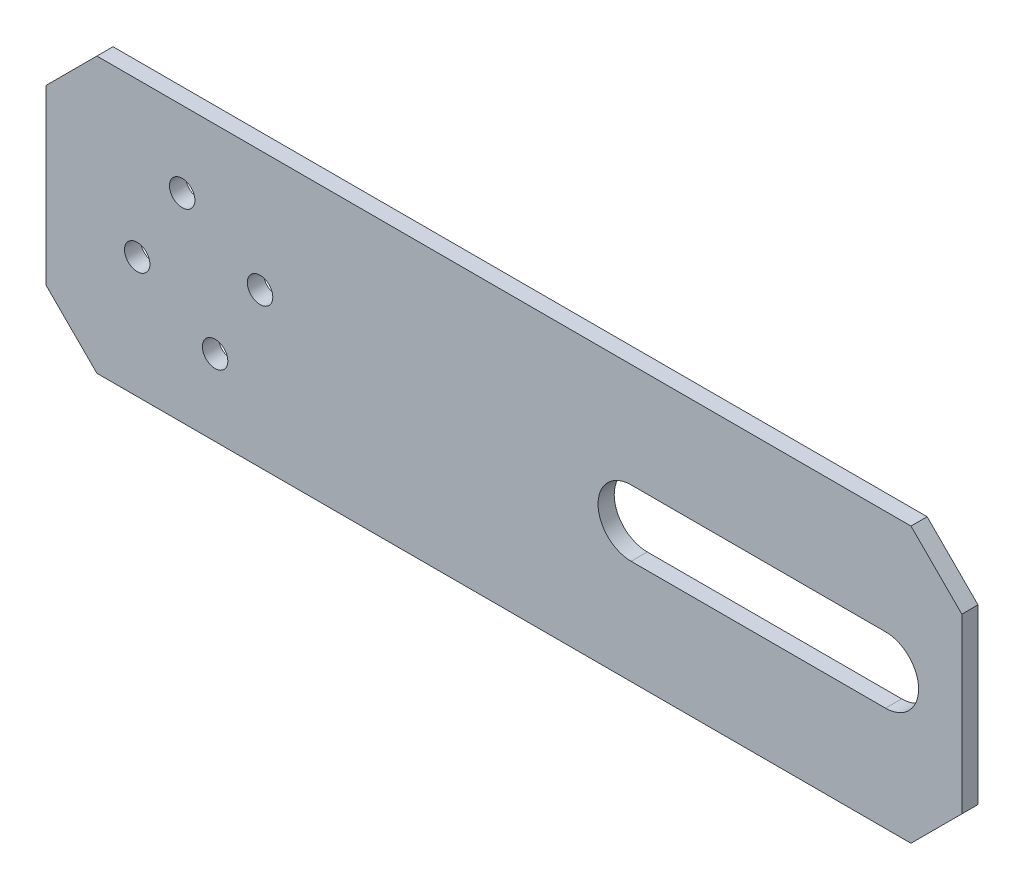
ISO-10303-21;
HEADER;
FILE_DESCRIPTION(('STEP AP214'),'2;1');
FILE_NAME('part.step','',(''),(''),'','','');
FILE_SCHEMA(('AUTOMOTIVE_DESIGN { 1 0 10303 214 1 1 1 1 }'));
ENDSEC;
DATA;
#1=APPLICATION_CONTEXT('core data for automotive mechanical design processes');
#2=APPLICATION_PROTOCOL_DEFINITION('international standard','automotive_design',2000,#1);
#3=PRODUCT_CONTEXT('',#1,'mechanical');
#4=PRODUCT('Part','Part','',(#3));
#5=PRODUCT_RELATED_PRODUCT_CATEGORY('part','',(#4));
#6=PRODUCT_DEFINITION_FORMATION('','',#4);
#7=PRODUCT_DEFINITION_CONTEXT('part definition',#1,'design');
#8=PRODUCT_DEFINITION('design','',#6,#7);
#9=PRODUCT_DEFINITION_SHAPE('','',#8);
#10=(LENGTH_UNIT() NAMED_UNIT(*) SI_UNIT(.MILLI.,.METRE.));
#11=(NAMED_UNIT(*) PLANE_ANGLE_UNIT() SI_UNIT($,.RADIAN.));
#12=(NAMED_UNIT(*) SI_UNIT($,.STERADIAN.) SOLID_ANGLE_UNIT());
#13=UNCERTAINTY_MEASURE_WITH_UNIT(LENGTH_MEASURE(1.E-05),#10,'distance_accuracy_value','');
#14=(GEOMETRIC_REPRESENTATION_CONTEXT(3) GLOBAL_UNCERTAINTY_ASSIGNED_CONTEXT((#13)) GLOBAL_UNIT_ASSIGNED_CONTEXT((#10,
#11,#12)) REPRESENTATION_CONTEXT('',''));
#15=CARTESIAN_POINT('',(0.,0.,0.));
#16=DIRECTION('',(0.,0.,1.));
#17=DIRECTION('',(1.,0.,0.));
#18=AXIS2_PLACEMENT_3D('',#15,#16,#17);
#19=CARTESIAN_POINT('',(-30.,-27.,1.5875));
#20=DIRECTION('',(0.,0.,1.));
#21=DIRECTION('',(1.,0.,0.));
#22=AXIS2_PLACEMENT_3D('',#19,#20,#21);
#23=PLANE('',#22);
#24=CARTESIAN_POINT('',(12.0740728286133,3.23523806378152,1.5875));
#25=DIRECTION('',(0.,0.,1.));
#26=DIRECTION('',(1.,0.,0.));
#27=AXIS2_PLACEMENT_3D('',#24,#25,#26);
#28=CIRCLE('',#27,2.50000000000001);
#29=CARTESIAN_POINT('',(14.5740728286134,3.23523806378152,1.5875));
#30=VERTEX_POINT('',#29);
#31=EDGE_CURVE('E171',#30,#30,#28,.T.);
#32=ORIENTED_EDGE('',*,*,#31,.F.);
#33=EDGE_LOOP('',(#32));
#34=FACE_BOUND('',#33,.T.);
#35=CARTESIAN_POINT('',(-3.23523806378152,12.0740728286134,1.5875));
#36=DIRECTION('',(0.,0.,1.));
#37=DIRECTION('',(1.,0.,0.));
#38=AXIS2_PLACEMENT_3D('',#35,#36,#37);
#39=CIRCLE('',#38,2.49999999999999);
#40=CARTESIAN_POINT('',(-0.735238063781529,12.0740728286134,1.5875));
#41=VERTEX_POINT('',#40);
#42=EDGE_CURVE('E183',#41,#41,#39,.T.);
#43=ORIENTED_EDGE('',*,*,#42,.F.);
#44=EDGE_LOOP('',(#43));
#45=FACE_BOUND('',#44,.T.);
#46=DIRECTION('',(-1.,0.,0.));
#47=VECTOR('',#46,1.);
#48=CARTESIAN_POINT('',(-30.,27.,1.5875));
#49=LINE('',#48,#47);
#50=CARTESIAN_POINT('',(140.,27.,1.5875));
#51=VERTEX_POINT('',#50);
#52=CARTESIAN_POINT('',(-19.9999999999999,27.,1.5875));
#53=VERTEX_POINT('',#52);
#54=EDGE_CURVE('E210',#51,#53,#49,.T.);
#55=ORIENTED_EDGE('',*,*,#54,.T.);
#56=DIRECTION('',(0.707106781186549,0.707106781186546,0.));
#57=VECTOR('',#56,1.);
#58=CARTESIAN_POINT('',(-52.,-4.99999999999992,1.5875));
#59=LINE('',#58,#57);
#60=CARTESIAN_POINT('',(-30.,17.,1.5875));
#61=VERTEX_POINT('',#60);
#62=EDGE_CURVE('E236',#53,#61,#59,.F.);
#63=ORIENTED_EDGE('',*,*,#62,.T.);
#64=DIRECTION('',(0.,-1.,0.));
#65=VECTOR('',#64,1.);
#66=CARTESIAN_POINT('',(-30.,27.,1.5875));
#67=LINE('',#66,#65);
#68=CARTESIAN_POINT('',(-30.,-17.,1.5875));
#69=VERTEX_POINT('',#68);
#70=EDGE_CURVE('E203',#61,#69,#67,.T.);
#71=ORIENTED_EDGE('',*,*,#70,.T.);
#72=DIRECTION('',(-0.707106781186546,0.707106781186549,0.));
#73=VECTOR('',#72,1.);
#74=CARTESIAN_POINT('',(-24.9999999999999,-22.,1.5875));
#75=LINE('',#74,#73);
#76=CARTESIAN_POINT('',(-19.9999999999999,-27.,1.5875));
#77=VERTEX_POINT('',#76);
#78=EDGE_CURVE('E234',#69,#77,#75,.F.);
#79=ORIENTED_EDGE('',*,*,#78,.T.);
#80=DIRECTION('',(1.,0.,0.));
#81=VECTOR('',#80,1.);
#82=CARTESIAN_POINT('',(-30.,-27.,1.5875));
#83=LINE('',#82,#81);
#84=CARTESIAN_POINT('',(140.,-27.,1.5875));
#85=VERTEX_POINT('',#84);
#86=EDGE_CURVE('E206',#77,#85,#83,.T.);
#87=ORIENTED_EDGE('',*,*,#86,.T.);
#88=DIRECTION('',(-0.707106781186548,-0.707106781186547,0.));
#89=VECTOR('',#88,1.);
#90=CARTESIAN_POINT('',(54.9999999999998,-112.,1.5875));
#91=LINE('',#90,#89);
#92=CARTESIAN_POINT('',(150.,-17.,1.5875));
#93=VERTEX_POINT('',#92);
#94=EDGE_CURVE('E57',#85,#93,#91,.F.);
#95=ORIENTED_EDGE('',*,*,#94,.T.);
#96=DIRECTION('',(0.,1.,0.));
#97=VECTOR('',#96,1.);
#98=CARTESIAN_POINT('',(150.,27.,1.5875));
#99=LINE('',#98,#97);
#100=CARTESIAN_POINT('',(150.,17.,1.5875));
#101=VERTEX_POINT('',#100);
#102=EDGE_CURVE('E208',#93,#101,#99,.T.);
#103=ORIENTED_EDGE('',*,*,#102,.T.);
#104=DIRECTION('',(0.707106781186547,-0.707106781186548,0.));
#105=VECTOR('',#104,1.);
#106=CARTESIAN_POINT('',(82.0000000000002,84.9999999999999,1.5875));
#107=LINE('',#106,#105);
#108=EDGE_CURVE('E232',#101,#51,#107,.F.);
#109=ORIENTED_EDGE('',*,*,#108,.T.);
#110=EDGE_LOOP('',(#55,#63,#71,#79,#87,#95,#103,#109));
#111=FACE_BOUND('',#110,.T.);
#112=CARTESIAN_POINT('',(-12.0740728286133,-3.23523806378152,1.5875));
#113=DIRECTION('',(0.,0.,1.));
#114=DIRECTION('',(1.,0.,0.));
#115=AXIS2_PLACEMENT_3D('',#112,#113,#114);
#116=CIRCLE('',#115,2.49999999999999);
#117=CARTESIAN_POINT('',(-9.57407282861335,-3.23523806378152,1.5875));
#118=VERTEX_POINT('',#117);
#119=EDGE_CURVE('E189',#118,#118,#116,.T.);
#120=ORIENTED_EDGE('',*,*,#119,.F.);
#121=EDGE_LOOP('',(#120));
#122=FACE_BOUND('',#121,.T.);
#123=CARTESIAN_POINT('',(3.23523806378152,-12.0740728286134,1.5875));
#124=DIRECTION('',(0.,0.,1.));
#125=DIRECTION('',(1.,0.,0.));
#126=AXIS2_PLACEMENT_3D('',#123,#124,#125);
#127=CIRCLE('',#126,2.49999999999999);
#128=CARTESIAN_POINT('',(5.73523806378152,-12.0740728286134,1.5875));
#129=VERTEX_POINT('',#128);
#130=EDGE_CURVE('E177',#129,#129,#127,.T.);
#131=ORIENTED_EDGE('',*,*,#130,.F.);
#132=EDGE_LOOP('',(#131));
#133=FACE_BOUND('',#132,.T.);
#134=DIRECTION('',(-1.,0.,0.));
#135=VECTOR('',#134,1.);
#136=CARTESIAN_POINT('',(135.,6.49999999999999,1.5875));
#137=LINE('',#136,#135);
#138=CARTESIAN_POINT('',(135.,6.49999999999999,1.5875));
#139=VERTEX_POINT('',#138);
#140=CARTESIAN_POINT('',(85.0000000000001,6.49999999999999,1.5875));
#141=VERTEX_POINT('',#140);
#142=EDGE_CURVE('E157',#139,#141,#137,.T.);
#143=ORIENTED_EDGE('',*,*,#142,.F.);
#144=CARTESIAN_POINT('',(135.,0.,1.5875));
#145=DIRECTION('',(0.,0.,1.));
#146=DIRECTION('',(1.,0.,0.));
#147=AXIS2_PLACEMENT_3D('',#144,#145,#146);
#148=CIRCLE('',#147,6.49999999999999);
#149=CARTESIAN_POINT('',(135.,-6.49999999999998,1.5875));
#150=VERTEX_POINT('',#149);
#151=EDGE_CURVE('E145',#150,#139,#148,.T.);
#152=ORIENTED_EDGE('',*,*,#151,.F.);
#153=DIRECTION('',(1.,0.,0.));
#154=VECTOR('',#153,1.);
#155=CARTESIAN_POINT('',(135.,-6.49999999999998,1.5875));
#156=LINE('',#155,#154);
#157=CARTESIAN_POINT('',(85.0000000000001,-6.49999999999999,1.5875));
#158=VERTEX_POINT('',#157);
#159=EDGE_CURVE('E162',#158,#150,#156,.T.);
#160=ORIENTED_EDGE('',*,*,#159,.F.);
#161=CARTESIAN_POINT('',(85.0000000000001,0.,1.5875));
#162=DIRECTION('',(0.,0.,1.));
#163=DIRECTION('',(1.,0.,0.));
#164=AXIS2_PLACEMENT_3D('',#161,#162,#163);
#165=CIRCLE('',#164,6.49999999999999);
#166=EDGE_CURVE('E159',#141,#158,#165,.T.);
#167=ORIENTED_EDGE('',*,*,#166,.F.);
#168=EDGE_LOOP('',(#143,#152,#160,#167));
#169=FACE_BOUND('',#168,.T.);
#170=ADVANCED_FACE('F37',(#34,#45,#111,#122,#133,#169),#23,.T.);
#171=CARTESIAN_POINT('',(-30.,-27.,-1.5875));
#172=DIRECTION('',(0.,0.,1.));
#173=DIRECTION('',(1.,0.,0.));
#174=AXIS2_PLACEMENT_3D('',#171,#172,#173);
#175=PLANE('',#174);
#176=CARTESIAN_POINT('',(12.0740728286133,3.23523806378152,-1.5875));
#177=DIRECTION('',(0.,0.,1.));
#178=DIRECTION('',(1.,0.,0.));
#179=AXIS2_PLACEMENT_3D('',#176,#177,#178);
#180=CIRCLE('',#179,2.50000000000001);
#181=CARTESIAN_POINT('',(14.5740728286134,3.23523806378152,-1.5875));
#182=VERTEX_POINT('',#181);
#183=EDGE_CURVE('E146',#182,#182,#180,.T.);
#184=ORIENTED_EDGE('',*,*,#183,.T.);
#185=EDGE_LOOP('',(#184));
#186=FACE_BOUND('',#185,.T.);
#187=CARTESIAN_POINT('',(-3.23523806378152,12.0740728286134,-1.5875));
#188=DIRECTION('',(0.,0.,1.));
#189=DIRECTION('',(1.,0.,0.));
#190=AXIS2_PLACEMENT_3D('',#187,#188,#189);
#191=CIRCLE('',#190,2.49999999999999);
#192=CARTESIAN_POINT('',(-0.735238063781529,12.0740728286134,-1.5875));
#193=VERTEX_POINT('',#192);
#194=EDGE_CURVE('E180',#193,#193,#191,.T.);
#195=ORIENTED_EDGE('',*,*,#194,.T.);
#196=EDGE_LOOP('',(#195));
#197=FACE_BOUND('',#196,.T.);
#198=DIRECTION('',(0.,-1.,0.));
#199=VECTOR('',#198,1.);
#200=CARTESIAN_POINT('',(-30.,27.,-1.5875));
#201=LINE('',#200,#199);
#202=CARTESIAN_POINT('',(-30.,17.,-1.5875));
#203=VERTEX_POINT('',#202);
#204=CARTESIAN_POINT('',(-30.,-17.,-1.5875));
#205=VERTEX_POINT('',#204);
#206=EDGE_CURVE('E192',#203,#205,#201,.T.);
#207=ORIENTED_EDGE('',*,*,#206,.F.);
#208=DIRECTION('',(-0.707106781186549,-0.707106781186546,0.));
#209=VECTOR('',#208,1.);
#210=CARTESIAN_POINT('',(-30.,17.,-1.5875));
#211=LINE('',#210,#209);
#212=CARTESIAN_POINT('',(-19.9999999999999,27.,-1.5875));
#213=VERTEX_POINT('',#212);
#214=EDGE_CURVE('E224',#203,#213,#211,.F.);
#215=ORIENTED_EDGE('',*,*,#214,.T.);
#216=DIRECTION('',(-1.,0.,0.));
#217=VECTOR('',#216,1.);
#218=CARTESIAN_POINT('',(-30.,27.,-1.5875));
#219=LINE('',#218,#217);
#220=CARTESIAN_POINT('',(140.,27.,-1.5875));
#221=VERTEX_POINT('',#220);
#222=EDGE_CURVE('E200',#221,#213,#219,.T.);
#223=ORIENTED_EDGE('',*,*,#222,.F.);
#224=DIRECTION('',(-0.707106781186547,0.707106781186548,0.));
#225=VECTOR('',#224,1.);
#226=CARTESIAN_POINT('',(140.,27.,-1.5875));
#227=LINE('',#226,#225);
#228=CARTESIAN_POINT('',(150.,17.,-1.5875));
#229=VERTEX_POINT('',#228);
#230=EDGE_CURVE('E220',#221,#229,#227,.F.);
#231=ORIENTED_EDGE('',*,*,#230,.T.);
#232=DIRECTION('',(0.,1.,0.));
#233=VECTOR('',#232,1.);
#234=CARTESIAN_POINT('',(150.,27.,-1.5875));
#235=LINE('',#234,#233);
#236=CARTESIAN_POINT('',(150.,-17.,-1.5875));
#237=VERTEX_POINT('',#236);
#238=EDGE_CURVE('E198',#237,#229,#235,.T.);
#239=ORIENTED_EDGE('',*,*,#238,.F.);
#240=DIRECTION('',(0.707106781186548,0.707106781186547,0.));
#241=VECTOR('',#240,1.);
#242=CARTESIAN_POINT('',(150.,-17.,-1.5875));
#243=LINE('',#242,#241);
#244=CARTESIAN_POINT('',(140.,-27.,-1.5875));
#245=VERTEX_POINT('',#244);
#246=EDGE_CURVE('E218',#237,#245,#243,.F.);
#247=ORIENTED_EDGE('',*,*,#246,.T.);
#248=DIRECTION('',(1.,0.,0.));
#249=VECTOR('',#248,1.);
#250=CARTESIAN_POINT('',(-30.,-27.,-1.5875));
#251=LINE('',#250,#249);
#252=CARTESIAN_POINT('',(-19.9999999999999,-27.,-1.5875));
#253=VERTEX_POINT('',#252);
#254=EDGE_CURVE('E195',#253,#245,#251,.T.);
#255=ORIENTED_EDGE('',*,*,#254,.F.);
#256=DIRECTION('',(0.707106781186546,-0.707106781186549,0.));
#257=VECTOR('',#256,1.);
#258=CARTESIAN_POINT('',(-19.9999999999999,-27.,-1.5875));
#259=LINE('',#258,#257);
#260=EDGE_CURVE('E222',#253,#205,#259,.F.);
#261=ORIENTED_EDGE('',*,*,#260,.T.);
#262=EDGE_LOOP('',(#207,#215,#223,#231,#239,#247,#255,#261));
#263=FACE_BOUND('',#262,.T.);
#264=CARTESIAN_POINT('',(-12.0740728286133,-3.23523806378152,-1.5875));
#265=DIRECTION('',(0.,0.,1.));
#266=DIRECTION('',(1.,0.,0.));
#267=AXIS2_PLACEMENT_3D('',#264,#265,#266);
#268=CIRCLE('',#267,2.49999999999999);
#269=CARTESIAN_POINT('',(-9.57407282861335,-3.23523806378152,-1.5875));
#270=VERTEX_POINT('',#269);
#271=EDGE_CURVE('E186',#270,#270,#268,.T.);
#272=ORIENTED_EDGE('',*,*,#271,.T.);
#273=EDGE_LOOP('',(#272));
#274=FACE_BOUND('',#273,.T.);
#275=CARTESIAN_POINT('',(3.23523806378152,-12.0740728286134,-1.5875));
#276=DIRECTION('',(0.,0.,1.));
#277=DIRECTION('',(1.,0.,0.));
#278=AXIS2_PLACEMENT_3D('',#275,#276,#277);
#279=CIRCLE('',#278,2.49999999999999);
#280=CARTESIAN_POINT('',(5.73523806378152,-12.0740728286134,-1.5875));
#281=VERTEX_POINT('',#280);
#282=EDGE_CURVE('E174',#281,#281,#279,.T.);
#283=ORIENTED_EDGE('',*,*,#282,.T.);
#284=EDGE_LOOP('',(#283));
#285=FACE_BOUND('',#284,.T.);
#286=CARTESIAN_POINT('',(135.,0.,-1.5875));
#287=DIRECTION('',(0.,0.,1.));
#288=DIRECTION('',(1.,0.,0.));
#289=AXIS2_PLACEMENT_3D('',#286,#287,#288);
#290=CIRCLE('',#289,6.49999999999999);
#291=CARTESIAN_POINT('',(135.,-6.49999999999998,-1.5875));
#292=VERTEX_POINT('',#291);
#293=CARTESIAN_POINT('',(135.,6.49999999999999,-1.5875));
#294=VERTEX_POINT('',#293);
#295=EDGE_CURVE('E138',#292,#294,#290,.T.);
#296=ORIENTED_EDGE('',*,*,#295,.T.);
#297=DIRECTION('',(-1.,0.,0.));
#298=VECTOR('',#297,1.);
#299=CARTESIAN_POINT('',(135.,6.49999999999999,-1.5875));
#300=LINE('',#299,#298);
#301=CARTESIAN_POINT('',(85.0000000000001,6.49999999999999,-1.5875));
#302=VERTEX_POINT('',#301);
#303=EDGE_CURVE('E126',#294,#302,#300,.T.);
#304=ORIENTED_EDGE('',*,*,#303,.T.);
#305=CARTESIAN_POINT('',(85.0000000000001,0.,-1.5875));
#306=DIRECTION('',(0.,0.,1.));
#307=DIRECTION('',(1.,0.,0.));
#308=AXIS2_PLACEMENT_3D('',#305,#306,#307);
#309=CIRCLE('',#308,6.49999999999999);
#310=CARTESIAN_POINT('',(85.0000000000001,-6.49999999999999,-1.5875));
#311=VERTEX_POINT('',#310);
#312=EDGE_CURVE('E137',#302,#311,#309,.T.);
#313=ORIENTED_EDGE('',*,*,#312,.T.);
#314=DIRECTION('',(1.,0.,0.));
#315=VECTOR('',#314,1.);
#316=CARTESIAN_POINT('',(135.,-6.49999999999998,-1.5875));
#317=LINE('',#316,#315);
#318=EDGE_CURVE('E151',#311,#292,#317,.T.);
#319=ORIENTED_EDGE('',*,*,#318,.T.);
#320=EDGE_LOOP('',(#296,#304,#313,#319));
#321=FACE_BOUND('',#320,.T.);
#322=ADVANCED_FACE('F149',(#186,#197,#263,#274,#285,#321),#175,.F.);
#323=CARTESIAN_POINT('',(-30.,27.,1.5875));
#324=DIRECTION('',(1.,0.,0.));
#325=DIRECTION('',(0.,1.,0.));
#326=AXIS2_PLACEMENT_3D('',#323,#324,#325);
#327=PLANE('',#326);
#328=ORIENTED_EDGE('',*,*,#70,.F.);
#329=DIRECTION('',(0.,0.,-1.));
#330=VECTOR('',#329,1.);
#331=CARTESIAN_POINT('',(-30.,17.,1.5875));
#332=LINE('',#331,#330);
#333=EDGE_CURVE('E215',#61,#203,#332,.T.);
#334=ORIENTED_EDGE('',*,*,#333,.T.);
#335=ORIENTED_EDGE('',*,*,#206,.T.);
#336=DIRECTION('',(0.,0.,1.));
#337=VECTOR('',#336,1.);
#338=CARTESIAN_POINT('',(-30.,-17.,1.5875));
#339=LINE('',#338,#337);
#340=EDGE_CURVE('E213',#205,#69,#339,.T.);
#341=ORIENTED_EDGE('',*,*,#340,.T.);
#342=EDGE_LOOP('',(#328,#334,#335,#341));
#343=FACE_BOUND('',#342,.T.);
#344=ADVANCED_FACE('F39',(#343),#327,.F.);
#345=CARTESIAN_POINT('',(-30.,-27.,1.5875));
#346=DIRECTION('',(0.,1.,0.));
#347=DIRECTION('',(0.,0.,1.));
#348=AXIS2_PLACEMENT_3D('',#345,#346,#347);
#349=PLANE('',#348);
#350=ORIENTED_EDGE('',*,*,#86,.F.);
#351=DIRECTION('',(0.,0.,-1.));
#352=VECTOR('',#351,1.);
#353=CARTESIAN_POINT('',(-19.9999999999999,-27.,1.5875));
#354=LINE('',#353,#352);
#355=EDGE_CURVE('E240',#77,#253,#354,.T.);
#356=ORIENTED_EDGE('',*,*,#355,.T.);
#357=ORIENTED_EDGE('',*,*,#254,.T.);
#358=DIRECTION('',(0.,0.,1.));
#359=VECTOR('',#358,1.);
#360=CARTESIAN_POINT('',(140.,-27.,1.5875));
#361=LINE('',#360,#359);
#362=EDGE_CURVE('E238',#245,#85,#361,.T.);
#363=ORIENTED_EDGE('',*,*,#362,.T.);
#364=EDGE_LOOP('',(#350,#356,#357,#363));
#365=FACE_BOUND('',#364,.T.);
#366=ADVANCED_FACE('F274',(#365),#349,.F.);
#367=CARTESIAN_POINT('',(150.,27.,1.5875));
#368=DIRECTION('',(-1.,0.,0.));
#369=DIRECTION('',(0.,0.,1.));
#370=AXIS2_PLACEMENT_3D('',#367,#368,#369);
#371=PLANE('',#370);
#372=ORIENTED_EDGE('',*,*,#238,.T.);
#373=DIRECTION('',(0.,0.,1.));
#374=VECTOR('',#373,1.);
#375=CARTESIAN_POINT('',(150.,17.,1.5875));
#376=LINE('',#375,#374);
#377=EDGE_CURVE('E11',#229,#101,#376,.T.);
#378=ORIENTED_EDGE('',*,*,#377,.T.);
#379=ORIENTED_EDGE('',*,*,#102,.F.);
#380=DIRECTION('',(0.,0.,-1.));
#381=VECTOR('',#380,1.);
#382=CARTESIAN_POINT('',(150.,-17.,1.5875));
#383=LINE('',#382,#381);
#384=EDGE_CURVE('E45',#93,#237,#383,.T.);
#385=ORIENTED_EDGE('',*,*,#384,.T.);
#386=EDGE_LOOP('',(#372,#378,#379,#385));
#387=FACE_BOUND('',#386,.T.);
#388=ADVANCED_FACE('F245',(#387),#371,.F.);
#389=CARTESIAN_POINT('',(-30.,27.,1.5875));
#390=DIRECTION('',(0.,-1.,0.));
#391=DIRECTION('',(0.,0.,-1.));
#392=AXIS2_PLACEMENT_3D('',#389,#390,#391);
#393=PLANE('',#392);
#394=ORIENTED_EDGE('',*,*,#222,.T.);
#395=DIRECTION('',(0.,0.,1.));
#396=VECTOR('',#395,1.);
#397=CARTESIAN_POINT('',(-19.9999999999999,27.,1.5875));
#398=LINE('',#397,#396);
#399=EDGE_CURVE('E229',#213,#53,#398,.T.);
#400=ORIENTED_EDGE('',*,*,#399,.T.);
#401=ORIENTED_EDGE('',*,*,#54,.F.);
#402=DIRECTION('',(0.,0.,-1.));
#403=VECTOR('',#402,1.);
#404=CARTESIAN_POINT('',(140.,27.,1.5875));
#405=LINE('',#404,#403);
#406=EDGE_CURVE('E226',#51,#221,#405,.T.);
#407=ORIENTED_EDGE('',*,*,#406,.T.);
#408=EDGE_LOOP('',(#394,#400,#401,#407));
#409=FACE_BOUND('',#408,.T.);
#410=ADVANCED_FACE('F258',(#409),#393,.F.);
#411=CARTESIAN_POINT('',(-12.0740728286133,-3.23523806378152,1.5875));
#412=DIRECTION('',(0.,0.,-1.));
#413=DIRECTION('',(-1.,0.,0.));
#414=AXIS2_PLACEMENT_3D('',#411,#412,#413);
#415=CYLINDRICAL_SURFACE('',#414,2.49999999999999);
#416=ORIENTED_EDGE('',*,*,#119,.T.);
#417=EDGE_LOOP('',(#416));
#418=FACE_BOUND('',#417,.T.);
#419=ORIENTED_EDGE('',*,*,#271,.F.);
#420=EDGE_LOOP('',(#419));
#421=FACE_BOUND('',#420,.T.);
#422=ADVANCED_FACE('F297',(#418,#421),#415,.F.);
#423=CARTESIAN_POINT('',(-3.23523806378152,12.0740728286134,1.5875));
#424=DIRECTION('',(0.,0.,-1.));
#425=DIRECTION('',(-1.,0.,0.));
#426=AXIS2_PLACEMENT_3D('',#423,#424,#425);
#427=CYLINDRICAL_SURFACE('',#426,2.49999999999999);
#428=ORIENTED_EDGE('',*,*,#42,.T.);
#429=EDGE_LOOP('',(#428));
#430=FACE_BOUND('',#429,.T.);
#431=ORIENTED_EDGE('',*,*,#194,.F.);
#432=EDGE_LOOP('',(#431));
#433=FACE_BOUND('',#432,.T.);
#434=ADVANCED_FACE('F371',(#430,#433),#427,.F.);
#435=CARTESIAN_POINT('',(3.23523806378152,-12.0740728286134,1.5875));
#436=DIRECTION('',(0.,0.,-1.));
#437=DIRECTION('',(-1.,0.,0.));
#438=AXIS2_PLACEMENT_3D('',#435,#436,#437);
#439=CYLINDRICAL_SURFACE('',#438,2.49999999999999);
#440=ORIENTED_EDGE('',*,*,#130,.T.);
#441=EDGE_LOOP('',(#440));
#442=FACE_BOUND('',#441,.T.);
#443=ORIENTED_EDGE('',*,*,#282,.F.);
#444=EDGE_LOOP('',(#443));
#445=FACE_BOUND('',#444,.T.);
#446=ADVANCED_FACE('F361',(#442,#445),#439,.F.);
#447=CARTESIAN_POINT('',(12.0740728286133,3.23523806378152,1.5875));
#448=DIRECTION('',(0.,0.,-1.));
#449=DIRECTION('',(-1.,0.,0.));
#450=AXIS2_PLACEMENT_3D('',#447,#448,#449);
#451=CYLINDRICAL_SURFACE('',#450,2.50000000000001);
#452=ORIENTED_EDGE('',*,*,#31,.T.);
#453=EDGE_LOOP('',(#452));
#454=FACE_BOUND('',#453,.T.);
#455=ORIENTED_EDGE('',*,*,#183,.F.);
#456=EDGE_LOOP('',(#455));
#457=FACE_BOUND('',#456,.T.);
#458=ADVANCED_FACE('F352',(#454,#457),#451,.F.);
#459=CARTESIAN_POINT('',(135.,0.,1.5875));
#460=DIRECTION('',(0.,0.,-1.));
#461=DIRECTION('',(-1.,0.,0.));
#462=AXIS2_PLACEMENT_3D('',#459,#460,#461);
#463=CYLINDRICAL_SURFACE('',#462,6.49999999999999);
#464=ORIENTED_EDGE('',*,*,#295,.F.);
#465=DIRECTION('',(0.,0.,-1.));
#466=VECTOR('',#465,1.);
#467=CARTESIAN_POINT('',(135.,-6.49999999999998,1.5875));
#468=LINE('',#467,#466);
#469=EDGE_CURVE('E164',#150,#292,#468,.T.);
#470=ORIENTED_EDGE('',*,*,#469,.F.);
#471=ORIENTED_EDGE('',*,*,#151,.T.);
#472=DIRECTION('',(0.,0.,-1.));
#473=VECTOR('',#472,1.);
#474=CARTESIAN_POINT('',(135.,6.49999999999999,1.5875));
#475=LINE('',#474,#473);
#476=EDGE_CURVE('E129',#139,#294,#475,.T.);
#477=ORIENTED_EDGE('',*,*,#476,.T.);
#478=EDGE_LOOP('',(#464,#470,#471,#477));
#479=FACE_BOUND('',#478,.T.);
#480=ADVANCED_FACE('F141',(#479),#463,.F.);
#481=CARTESIAN_POINT('',(135.,6.49999999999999,1.5875));
#482=DIRECTION('',(0.,-1.,0.));
#483=DIRECTION('',(1.,0.,0.));
#484=AXIS2_PLACEMENT_3D('',#481,#482,#483);
#485=PLANE('',#484);
#486=ORIENTED_EDGE('',*,*,#303,.F.);
#487=ORIENTED_EDGE('',*,*,#476,.F.);
#488=ORIENTED_EDGE('',*,*,#142,.T.);
#489=DIRECTION('',(0.,0.,-1.));
#490=VECTOR('',#489,1.);
#491=CARTESIAN_POINT('',(85.0000000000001,6.49999999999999,1.5875));
#492=LINE('',#491,#490);
#493=EDGE_CURVE('E132',#141,#302,#492,.T.);
#494=ORIENTED_EDGE('',*,*,#493,.T.);
#495=EDGE_LOOP('',(#486,#487,#488,#494));
#496=FACE_BOUND('',#495,.T.);
#497=ADVANCED_FACE('F128',(#496),#485,.T.);
#498=CARTESIAN_POINT('',(85.0000000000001,0.,1.5875));
#499=DIRECTION('',(0.,0.,-1.));
#500=DIRECTION('',(-1.,0.,0.));
#501=AXIS2_PLACEMENT_3D('',#498,#499,#500);
#502=CYLINDRICAL_SURFACE('',#501,6.49999999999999);
#503=ORIENTED_EDGE('',*,*,#312,.F.);
#504=ORIENTED_EDGE('',*,*,#493,.F.);
#505=ORIENTED_EDGE('',*,*,#166,.T.);
#506=DIRECTION('',(0.,0.,-1.));
#507=VECTOR('',#506,1.);
#508=CARTESIAN_POINT('',(85.0000000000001,-6.49999999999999,1.5875));
#509=LINE('',#508,#507);
#510=EDGE_CURVE('E166',#158,#311,#509,.T.);
#511=ORIENTED_EDGE('',*,*,#510,.T.);
#512=EDGE_LOOP('',(#503,#504,#505,#511));
#513=FACE_BOUND('',#512,.T.);
#514=ADVANCED_FACE('F323',(#513),#502,.F.);
#515=CARTESIAN_POINT('',(135.,-6.49999999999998,1.5875));
#516=DIRECTION('',(0.,1.,0.));
#517=DIRECTION('',(-1.,0.,0.));
#518=AXIS2_PLACEMENT_3D('',#515,#516,#517);
#519=PLANE('',#518);
#520=ORIENTED_EDGE('',*,*,#318,.F.);
#521=ORIENTED_EDGE('',*,*,#510,.F.);
#522=ORIENTED_EDGE('',*,*,#159,.T.);
#523=ORIENTED_EDGE('',*,*,#469,.T.);
#524=EDGE_LOOP('',(#520,#521,#522,#523));
#525=FACE_BOUND('',#524,.T.);
#526=ADVANCED_FACE('F318',(#525),#519,.T.);
#527=CARTESIAN_POINT('',(-30.,17.,1.5875));
#528=DIRECTION('',(0.707106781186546,-0.707106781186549,0.));
#529=DIRECTION('',(0.707106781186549,0.707106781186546,0.));
#530=AXIS2_PLACEMENT_3D('',#527,#528,#529);
#531=PLANE('',#530);
#532=ORIENTED_EDGE('',*,*,#62,.F.);
#533=ORIENTED_EDGE('',*,*,#399,.F.);
#534=ORIENTED_EDGE('',*,*,#214,.F.);
#535=ORIENTED_EDGE('',*,*,#333,.F.);
#536=EDGE_LOOP('',(#532,#533,#534,#535));
#537=FACE_BOUND('',#536,.T.);
#538=ADVANCED_FACE('F265',(#537),#531,.F.);
#539=CARTESIAN_POINT('',(-19.9999999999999,-27.,1.5875));
#540=DIRECTION('',(0.707106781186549,0.707106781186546,0.));
#541=DIRECTION('',(-0.707106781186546,0.707106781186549,0.));
#542=AXIS2_PLACEMENT_3D('',#539,#540,#541);
#543=PLANE('',#542);
#544=ORIENTED_EDGE('',*,*,#78,.F.);
#545=ORIENTED_EDGE('',*,*,#340,.F.);
#546=ORIENTED_EDGE('',*,*,#260,.F.);
#547=ORIENTED_EDGE('',*,*,#355,.F.);
#548=EDGE_LOOP('',(#544,#545,#546,#547));
#549=FACE_BOUND('',#548,.T.);
#550=ADVANCED_FACE('F271',(#549),#543,.F.);
#551=CARTESIAN_POINT('',(140.,27.,1.5875));
#552=DIRECTION('',(-0.707106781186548,-0.707106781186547,0.));
#553=DIRECTION('',(0.707106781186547,-0.707106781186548,0.));
#554=AXIS2_PLACEMENT_3D('',#551,#552,#553);
#555=PLANE('',#554);
#556=ORIENTED_EDGE('',*,*,#108,.F.);
#557=ORIENTED_EDGE('',*,*,#377,.F.);
#558=ORIENTED_EDGE('',*,*,#230,.F.);
#559=ORIENTED_EDGE('',*,*,#406,.F.);
#560=EDGE_LOOP('',(#556,#557,#558,#559));
#561=FACE_BOUND('',#560,.T.);
#562=ADVANCED_FACE('F255',(#561),#555,.F.);
#563=CARTESIAN_POINT('',(150.,-17.,1.5875));
#564=DIRECTION('',(-0.707106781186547,0.707106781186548,0.));
#565=DIRECTION('',(-0.707106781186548,-0.707106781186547,0.));
#566=AXIS2_PLACEMENT_3D('',#563,#564,#565);
#567=PLANE('',#566);
#568=ORIENTED_EDGE('',*,*,#94,.F.);
#569=ORIENTED_EDGE('',*,*,#362,.F.);
#570=ORIENTED_EDGE('',*,*,#246,.F.);
#571=ORIENTED_EDGE('',*,*,#384,.F.);
#572=EDGE_LOOP('',(#568,#569,#570,#571));
#573=FACE_BOUND('',#572,.T.);
#574=ADVANCED_FACE('F276',(#573),#567,.F.);
#575=CLOSED_SHELL('',(#170,#322,#344,#366,#388,#410,#422,#434,#446,#458,#480,#497,#514,#526,
#538,#550,#562,#574));
#576=MANIFOLD_SOLID_BREP('B2',#575);
#577=ADVANCED_BREP_SHAPE_REPRESENTATION('',(#18,#576),#14);
#578=SHAPE_DEFINITION_REPRESENTATION(#9,#577);
ENDSEC;
END-ISO-10303-21;
